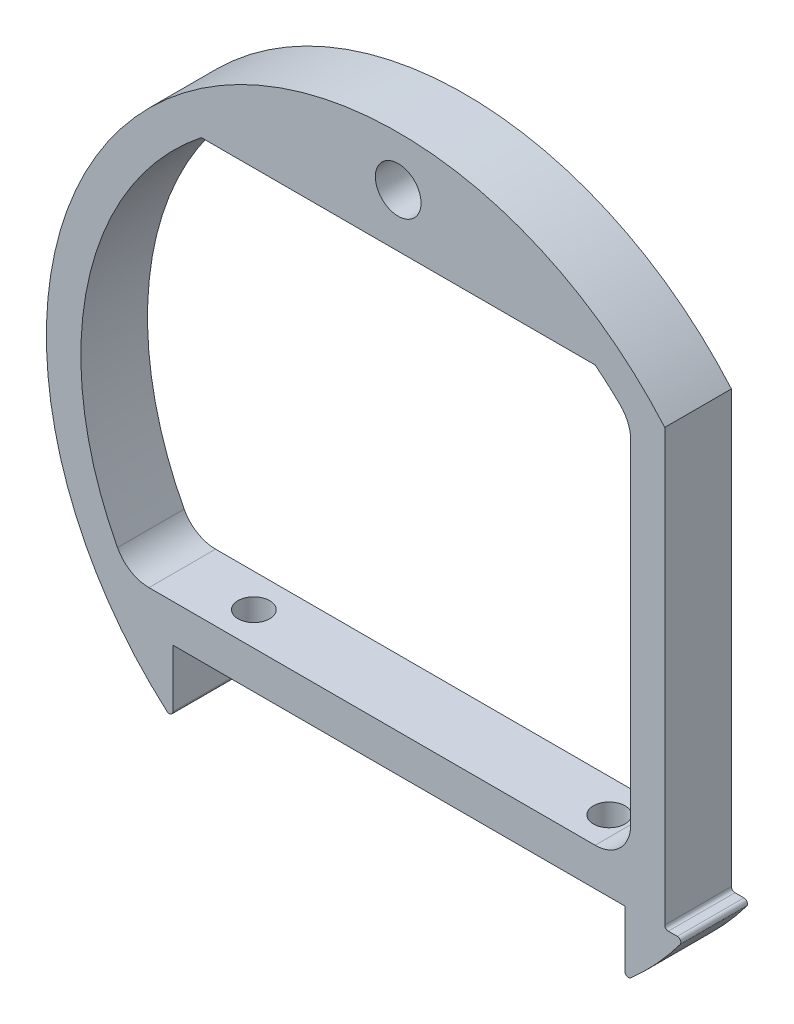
from build123d import *

# Parameters (mm, degrees)
SKETCH1_R                 = 25.146
BOSS_EXTRUDE1_DEPTH       = 4.7625
SKETCH2_W                 = 48.957581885
SKETCH2_H                 = 12.184537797
CUT_EXTRUDE1_DEPTH        = 4.7625
SKETCH3_W                 = 10.7450563
SKETCH3_H                 = 50.385787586
CUT_EXTRUDE3_DEPTH        = 4.7625
BOSS_EXTRUDE2_START       = -4.7625
BOSS_EXTRUDE2_DEPTH       = 4.7625
FILLET2_R                 = 0.254
F_4_40_TAPPED_HOLE1_D     = 2.2606
F_4_40_TAPPED_HOLE1_DEPTH = 6.096
F_4_40_TAPPED_HOLE1_TIP   = 0.679152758
CUT_EXTRUDE4_DEPTH        = 4.7625
FILLET3_R                 = 2.54
BOSS_EXTRUDE3_DEPTH       = 4.7625
F_4_CLEARANCE_HOLE1_D     = 3.2639
F_4_CLEARANCE_HOLE1_DEPTH = 25.4
F_4_CLEARANCE_HOLE1_TIP   = 0.980574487


with BuildPart() as part:
    # Sketch1 → Boss-Extrude1 (new body)
    with BuildSketch(Plane.XY):
        with Locations(Location((0, 0, 0), (0, 0, 180))):
            Circle(SKETCH1_R)
    extrude(amount=BOSS_EXTRUDE1_DEPTH)

    # Sketch2 → Cut-Extrude1 (cut)
    with BuildSketch(Plane.XY.offset(4.7625)):
        with Locations((-0.439738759, -20.731795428)):
            Rectangle(SKETCH2_W, SKETCH2_H)
    extrude(amount=-CUT_EXTRUDE1_DEPTH, mode=Mode.SUBTRACT)

    # Sketch3 → Cut-Extrude3 (cut)
    with BuildSketch(Plane.XY.offset(4.7625)):
        with Locations((24.42252815, -1.380393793)):
            Rectangle(SKETCH3_W, SKETCH3_H)
    extrude(amount=-CUT_EXTRUDE3_DEPTH, mode=Mode.SUBTRACT)

    # Sketch5 → Boss-Extrude2 (add)
    with BuildSketch(Plane.XY.offset(4.7625).offset(BOSS_EXTRUDE2_START)):
        with BuildLine():
            Line((16.194175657, -14.639526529), (16.194175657, -19.2372033))
            ThreePointArc((16.194175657, -19.2372033), (18.463351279, -17.071203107), (20.445184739, -14.639526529))
            Line((20.445184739, -14.639526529), (19.05, -14.639526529))
            Line((19.05, -14.639526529), (16.194175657, -14.639526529))
        make_face()
        with BuildLine():
            Line((-16.106701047, -14.639526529), (-16.106701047, -19.310502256))
            ThreePointArc((-16.106701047, -19.310502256), (-18.424564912, -17.113057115), (-20.445184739, -14.639526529))
            Line((-20.445184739, -14.639526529), (-16.106701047, -14.639526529))
        make_face()
    extrude(amount=BOSS_EXTRUDE2_DEPTH)

    # Fillet2
    fillet2_edges = [part.edges().sort_by_distance(p)[0] for p in [
        (19.05, -14.639526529, 2.38125),
        (20.445184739, -14.639526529, 2.38125),
        (16.194175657, -19.2372033, 2.38125),
        (-16.106701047, -19.310502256, 2.38125),
    ]]
    fillet(fillet2_edges, radius=FILLET2_R)

    # 4-40 Tapped Hole1
    with Locations(Plane(origin=(0, -14.639526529, 0), x_dir=(-1, 0, 0), z_dir=(0, -1, 0))):
        with Locations((12.7, -2.38125), (-12.7, -2.38125)):
            Hole(F_4_40_TAPPED_HOLE1_D / 2, depth=F_4_40_TAPPED_HOLE1_DEPTH)
            with Locations((0, 0, -(F_4_40_TAPPED_HOLE1_DEPTH + F_4_40_TAPPED_HOLE1_TIP / 2))):  # 118° drill point
                Cone(0, F_4_40_TAPPED_HOLE1_D / 2, F_4_40_TAPPED_HOLE1_TIP, mode=Mode.SUBTRACT)

    # Sketch8 → Cut-Extrude4 (cut)
    with BuildSketch(Plane.XY.offset(4.7625)):
        with BuildLine():
            Line((16.616806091, 11.936268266), (16.616806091, 15.439137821))
            ThreePointArc((16.616806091, 15.439137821), (-13.752689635, 18.037426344), (-19.287579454, -11.936268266))
            Line((-19.287579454, -11.936268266), (16.616806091, -11.936268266))
            Line((16.616806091, -11.936268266), (16.616806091, 11.936268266))
        make_face()
    extrude(amount=-CUT_EXTRUDE4_DEPTH, mode=Mode.SUBTRACT)

    # Fillet3
    fillet3_edges = [part.edges().sort_by_distance(p)[0] for p in [
        (16.616806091, -11.936268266, 2.38125),
        (-19.287579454, -11.936268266, 2.38125),
        (16.616806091, 15.439137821, 2.38125),
    ]]
    fillet(fillet3_edges, radius=FILLET3_R)


with BuildPart() as body_2:
    # Sketch9 → Boss-Extrude3 (new body)
    with BuildSketch(Plane.XY.offset(4.7625)):
        with BuildLine():
            Line((-14.072345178, 17.789163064), (14.072345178, 17.789163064))
            ThreePointArc((14.072345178, 17.789163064), (0, 22.682266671), (-14.072345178, 17.789163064))
        make_face()
    extrude(amount=-BOSS_EXTRUDE3_DEPTH)


with BuildPart() as part_1:
    add(part.part)

    # Combine1: union body 2
    add(body_2.part)

    # 4 Clearance Hole1
    with Locations(Plane.XY.offset(4.7625)):
        with Locations((0, 21.59)):
            Hole(F_4_CLEARANCE_HOLE1_D / 2, depth=F_4_CLEARANCE_HOLE1_DEPTH)
            with Locations((0, 0, -(F_4_CLEARANCE_HOLE1_DEPTH + F_4_CLEARANCE_HOLE1_TIP / 2))):  # 118° drill point
                Cone(0, F_4_CLEARANCE_HOLE1_D / 2, F_4_CLEARANCE_HOLE1_TIP, mode=Mode.SUBTRACT)


solid = part_1.part
